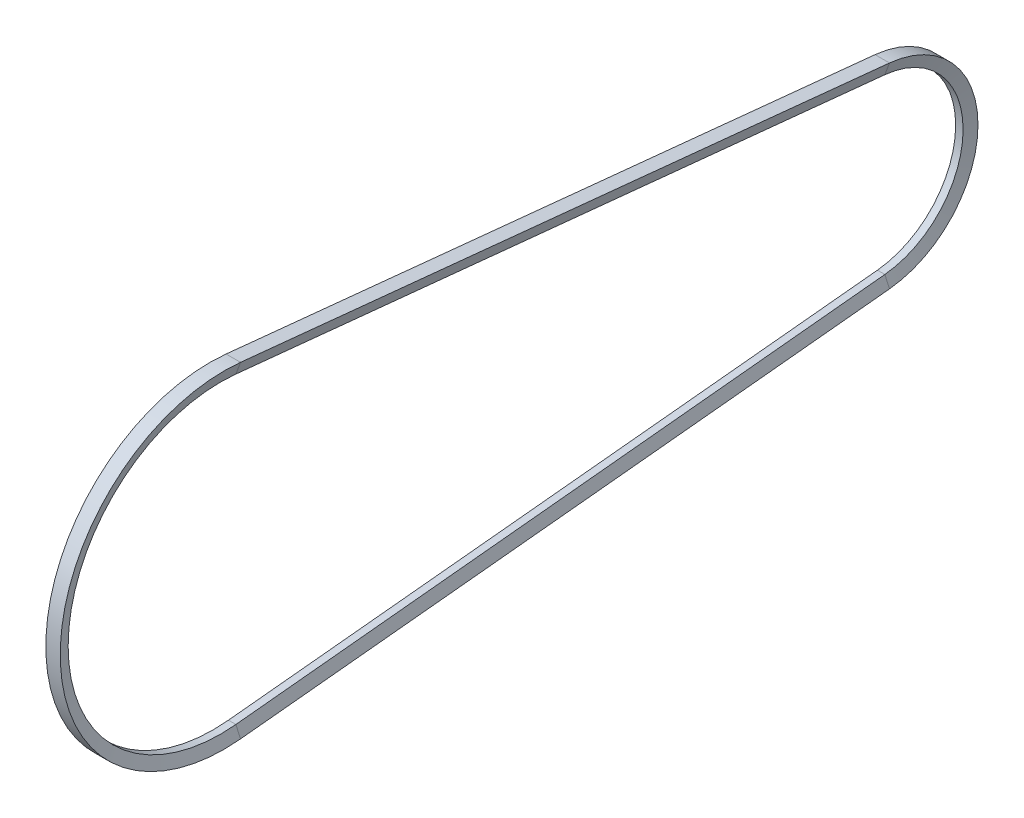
ISO-10303-21;
HEADER;
FILE_DESCRIPTION(('STEP AP214'),'2;1');
FILE_NAME('part.step','',(''),(''),'','','');
FILE_SCHEMA(('AUTOMOTIVE_DESIGN { 1 0 10303 214 1 1 1 1 }'));
ENDSEC;
DATA;
#1=APPLICATION_CONTEXT('core data for automotive mechanical design processes');
#2=APPLICATION_PROTOCOL_DEFINITION('international standard','automotive_design',2000,#1);
#3=PRODUCT_CONTEXT('',#1,'mechanical');
#4=PRODUCT('Part','Part','',(#3));
#5=PRODUCT_RELATED_PRODUCT_CATEGORY('part','',(#4));
#6=PRODUCT_DEFINITION_FORMATION('','',#4);
#7=PRODUCT_DEFINITION_CONTEXT('part definition',#1,'design');
#8=PRODUCT_DEFINITION('design','',#6,#7);
#9=PRODUCT_DEFINITION_SHAPE('','',#8);
#10=(LENGTH_UNIT() NAMED_UNIT(*) SI_UNIT(.MILLI.,.METRE.));
#11=(NAMED_UNIT(*) PLANE_ANGLE_UNIT() SI_UNIT($,.RADIAN.));
#12=(NAMED_UNIT(*) SI_UNIT($,.STERADIAN.) SOLID_ANGLE_UNIT());
#13=UNCERTAINTY_MEASURE_WITH_UNIT(LENGTH_MEASURE(1.E-05),#10,'distance_accuracy_value','');
#14=(GEOMETRIC_REPRESENTATION_CONTEXT(3) GLOBAL_UNCERTAINTY_ASSIGNED_CONTEXT((#13)) GLOBAL_UNIT_ASSIGNED_CONTEXT((#10,
#11,#12)) REPRESENTATION_CONTEXT('',''));
#15=CARTESIAN_POINT('',(0.,0.,0.));
#16=DIRECTION('',(0.,0.,1.));
#17=DIRECTION('',(1.,0.,0.));
#18=AXIS2_PLACEMENT_3D('',#15,#16,#17);
#19=CARTESIAN_POINT('',(2.84014307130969,65.967667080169,-506.629999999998));
#20=DIRECTION('',(0.,-0.99498743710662,0.1));
#21=DIRECTION('',(0.,-0.1,-0.99498743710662));
#22=AXIS2_PLACEMENT_3D('',#19,#20,#21);
#23=PLANE('',#22);
#24=DIRECTION('',(1.,0.,0.));
#25=VECTOR('',#24,1.);
#26=CARTESIAN_POINT('',(2.84014307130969,65.967667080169,-506.629999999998));
#27=LINE('',#26,#25);
#28=CARTESIAN_POINT('',(-2.84014307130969,65.967667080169,-506.629999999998));
#29=VERTEX_POINT('',#28);
#30=CARTESIAN_POINT('',(2.84014307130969,65.967667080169,-506.629999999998));
#31=VERTEX_POINT('',#30);
#32=EDGE_CURVE('E157',#29,#31,#27,.T.);
#33=ORIENTED_EDGE('',*,*,#32,.T.);
#34=DIRECTION('',(0.,0.1,0.99498743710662));
#35=VECTOR('',#34,1.);
#36=CARTESIAN_POINT('',(2.84014307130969,65.967667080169,-506.629999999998));
#37=LINE('',#36,#35);
#38=CARTESIAN_POINT('',(2.84014307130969,115.7170389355,-11.6299999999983));
#39=VERTEX_POINT('',#38);
#40=EDGE_CURVE('E38',#31,#39,#37,.T.);
#41=ORIENTED_EDGE('',*,*,#40,.T.);
#42=DIRECTION('',(1.,0.,0.));
#43=VECTOR('',#42,1.);
#44=CARTESIAN_POINT('',(2.84014307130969,115.7170389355,-11.6299999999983));
#45=LINE('',#44,#43);
#46=CARTESIAN_POINT('',(-2.84014307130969,115.7170389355,-11.6299999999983));
#47=VERTEX_POINT('',#46);
#48=EDGE_CURVE('E178',#47,#39,#45,.T.);
#49=ORIENTED_EDGE('',*,*,#48,.F.);
#50=DIRECTION('',(0.,0.1,0.99498743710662));
#51=VECTOR('',#50,1.);
#52=CARTESIAN_POINT('',(-2.84014307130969,65.967667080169,-506.629999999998));
#53=LINE('',#52,#51);
#54=EDGE_CURVE('E11',#29,#47,#53,.T.);
#55=ORIENTED_EDGE('',*,*,#54,.F.);
#56=EDGE_LOOP('',(#33,#41,#49,#55));
#57=FACE_BOUND('',#56,.T.);
#58=ADVANCED_FACE('F30',(#57),#23,.T.);
#59=CARTESIAN_POINT('',(5.5,74.6240577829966,-507.499999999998));
#60=DIRECTION('',(0.956304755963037,-0.290906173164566,0.0292371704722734));
#61=DIRECTION('',(0.29103058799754,0.956713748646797,0.));
#62=AXIS2_PLACEMENT_3D('',#59,#60,#61);
#63=PLANE('',#62);
#64=DIRECTION('',(0.292371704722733,0.951511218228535,-0.0956304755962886));
#65=VECTOR('',#64,1.);
#66=CARTESIAN_POINT('',(5.5,74.6240577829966,-507.499999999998));
#67=LINE('',#66,#65);
#68=CARTESIAN_POINT('',(5.5,74.6240577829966,-507.499999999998));
#69=VERTEX_POINT('',#68);
#70=EDGE_CURVE('E154',#31,#69,#67,.T.);
#71=ORIENTED_EDGE('',*,*,#70,.T.);
#72=DIRECTION('',(0.,0.1,0.99498743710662));
#73=VECTOR('',#72,1.);
#74=CARTESIAN_POINT('',(5.5,74.6240577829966,-507.499999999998));
#75=LINE('',#74,#73);
#76=CARTESIAN_POINT('',(5.5,124.373429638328,-12.4999999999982));
#77=VERTEX_POINT('',#76);
#78=EDGE_CURVE('E183',#69,#77,#75,.T.);
#79=ORIENTED_EDGE('',*,*,#78,.T.);
#80=DIRECTION('',(0.292371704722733,0.951511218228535,-0.0956304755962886));
#81=VECTOR('',#80,1.);
#82=CARTESIAN_POINT('',(5.5,124.373429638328,-12.4999999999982));
#83=LINE('',#82,#81);
#84=EDGE_CURVE('E176',#39,#77,#83,.T.);
#85=ORIENTED_EDGE('',*,*,#84,.F.);
#86=ORIENTED_EDGE('',*,*,#40,.F.);
#87=EDGE_LOOP('',(#71,#79,#85,#86));
#88=FACE_BOUND('',#87,.T.);
#89=ADVANCED_FACE('F207',(#88),#63,.T.);
#90=CARTESIAN_POINT('',(-5.5,74.6240577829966,-507.499999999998));
#91=DIRECTION('',(0.,0.99498743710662,-0.1));
#92=DIRECTION('',(0.,0.1,0.99498743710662));
#93=AXIS2_PLACEMENT_3D('',#90,#91,#92);
#94=PLANE('',#93);
#95=DIRECTION('',(-1.,0.,0.));
#96=VECTOR('',#95,1.);
#97=CARTESIAN_POINT('',(-5.5,74.6240577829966,-507.499999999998));
#98=LINE('',#97,#96);
#99=CARTESIAN_POINT('',(-5.5,74.6240577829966,-507.499999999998));
#100=VERTEX_POINT('',#99);
#101=EDGE_CURVE('E151',#69,#100,#98,.T.);
#102=ORIENTED_EDGE('',*,*,#101,.T.);
#103=DIRECTION('',(0.,0.1,0.99498743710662));
#104=VECTOR('',#103,1.);
#105=CARTESIAN_POINT('',(-5.5,74.6240577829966,-507.499999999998));
#106=LINE('',#105,#104);
#107=CARTESIAN_POINT('',(-5.5,124.373429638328,-12.4999999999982));
#108=VERTEX_POINT('',#107);
#109=EDGE_CURVE('E180',#100,#108,#106,.T.);
#110=ORIENTED_EDGE('',*,*,#109,.T.);
#111=DIRECTION('',(-1.,0.,0.));
#112=VECTOR('',#111,1.);
#113=CARTESIAN_POINT('',(-5.5,124.373429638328,-12.4999999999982));
#114=LINE('',#113,#112);
#115=EDGE_CURVE('E173',#77,#108,#114,.T.);
#116=ORIENTED_EDGE('',*,*,#115,.F.);
#117=ORIENTED_EDGE('',*,*,#78,.F.);
#118=EDGE_LOOP('',(#102,#110,#116,#117));
#119=FACE_BOUND('',#118,.T.);
#120=ADVANCED_FACE('F206',(#119),#94,.T.);
#121=CARTESIAN_POINT('',(-2.84014307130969,65.967667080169,-506.629999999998));
#122=DIRECTION('',(-0.956304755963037,-0.290906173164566,0.0292371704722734));
#123=DIRECTION('',(0.29103058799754,-0.956713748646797,0.));
#124=AXIS2_PLACEMENT_3D('',#121,#122,#123);
#125=PLANE('',#124);
#126=DIRECTION('',(0.292371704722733,-0.951511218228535,0.0956304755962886));
#127=VECTOR('',#126,1.);
#128=CARTESIAN_POINT('',(-2.84014307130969,65.967667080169,-506.629999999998));
#129=LINE('',#128,#127);
#130=EDGE_CURVE('E109',#100,#29,#129,.T.);
#131=ORIENTED_EDGE('',*,*,#130,.T.);
#132=ORIENTED_EDGE('',*,*,#54,.T.);
#133=DIRECTION('',(0.292371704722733,-0.951511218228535,0.0956304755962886));
#134=VECTOR('',#133,1.);
#135=CARTESIAN_POINT('',(-2.84014307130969,115.7170389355,-11.6299999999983));
#136=LINE('',#135,#134);
#137=EDGE_CURVE('E122',#108,#47,#136,.T.);
#138=ORIENTED_EDGE('',*,*,#137,.F.);
#139=ORIENTED_EDGE('',*,*,#109,.F.);
#140=EDGE_LOOP('',(#131,#132,#138,#139));
#141=FACE_BOUND('',#140,.T.);
#142=ADVANCED_FACE('F240',(#141),#125,.T.);
#143=CARTESIAN_POINT('',(0.,0.,-500.));
#144=DIRECTION('',(1.,0.,0.));
#145=DIRECTION('',(0.,0.,-1.));
#146=AXIS2_PLACEMENT_3D('',#143,#144,#145);
#147=CYLINDRICAL_SURFACE('',#146,66.2999999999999);
#148=DIRECTION('',(1.,0.,0.));
#149=VECTOR('',#148,1.);
#150=CARTESIAN_POINT('',(2.84014307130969,-65.9676670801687,-506.630000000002));
#151=LINE('',#150,#149);
#152=CARTESIAN_POINT('',(-2.84014307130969,-65.9676670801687,-506.630000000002));
#153=VERTEX_POINT('',#152);
#154=CARTESIAN_POINT('',(2.84014307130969,-65.9676670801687,-506.630000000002));
#155=VERTEX_POINT('',#154);
#156=EDGE_CURVE('E106',#153,#155,#151,.T.);
#157=ORIENTED_EDGE('',*,*,#156,.T.);
#158=CARTESIAN_POINT('',(2.84014307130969,0.,-500.));
#159=DIRECTION('',(1.,0.,0.));
#160=DIRECTION('',(0.,0.,-1.));
#161=AXIS2_PLACEMENT_3D('',#158,#159,#160);
#162=CIRCLE('',#161,66.2999999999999);
#163=EDGE_CURVE('E166',#155,#31,#162,.T.);
#164=ORIENTED_EDGE('',*,*,#163,.T.);
#165=ORIENTED_EDGE('',*,*,#32,.F.);
#166=CARTESIAN_POINT('',(-2.84014307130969,0.,-500.));
#167=DIRECTION('',(1.,0.,0.));
#168=DIRECTION('',(0.,0.,-1.));
#169=AXIS2_PLACEMENT_3D('',#166,#167,#168);
#170=CIRCLE('',#169,66.2999999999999);
#171=EDGE_CURVE('E169',#153,#29,#170,.T.);
#172=ORIENTED_EDGE('',*,*,#171,.F.);
#173=EDGE_LOOP('',(#157,#164,#165,#172));
#174=FACE_BOUND('',#173,.T.);
#175=ADVANCED_FACE('F237',(#174),#147,.F.);
#176=CARTESIAN_POINT('',(2.84014307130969,0.,-500.));
#177=DIRECTION('',(1.,0.,0.));
#178=DIRECTION('',(0.,0.,-1.));
#179=AXIS2_PLACEMENT_3D('',#176,#177,#178);
#180=CONICAL_SURFACE('',#179,66.2999999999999,1.27409035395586);
#181=DIRECTION('',(0.292371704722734,-0.951511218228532,-0.0956304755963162));
#182=VECTOR('',#181,1.);
#183=CARTESIAN_POINT('',(5.5,-74.6240577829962,-507.500000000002));
#184=LINE('',#183,#182);
#185=CARTESIAN_POINT('',(5.5,-74.6240577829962,-507.500000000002));
#186=VERTEX_POINT('',#185);
#187=EDGE_CURVE('E140',#155,#186,#184,.T.);
#188=ORIENTED_EDGE('',*,*,#187,.T.);
#189=CARTESIAN_POINT('',(5.5,0.,-500.));
#190=DIRECTION('',(1.,0.,0.));
#191=DIRECTION('',(0.,0.,-1.));
#192=AXIS2_PLACEMENT_3D('',#189,#190,#191);
#193=CIRCLE('',#192,74.9999999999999);
#194=EDGE_CURVE('E163',#186,#69,#193,.T.);
#195=ORIENTED_EDGE('',*,*,#194,.T.);
#196=ORIENTED_EDGE('',*,*,#70,.F.);
#197=ORIENTED_EDGE('',*,*,#163,.F.);
#198=EDGE_LOOP('',(#188,#195,#196,#197));
#199=FACE_BOUND('',#198,.T.);
#200=ADVANCED_FACE('F214',(#199),#180,.F.);
#201=CARTESIAN_POINT('',(0.,0.,-500.));
#202=DIRECTION('',(1.,0.,0.));
#203=DIRECTION('',(0.,0.,-1.));
#204=AXIS2_PLACEMENT_3D('',#201,#202,#203);
#205=CYLINDRICAL_SURFACE('',#204,74.9999999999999);
#206=DIRECTION('',(-1.,0.,0.));
#207=VECTOR('',#206,1.);
#208=CARTESIAN_POINT('',(-5.5,-74.6240577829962,-507.500000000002));
#209=LINE('',#208,#207);
#210=CARTESIAN_POINT('',(-5.5,-74.6240577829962,-507.500000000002));
#211=VERTEX_POINT('',#210);
#212=EDGE_CURVE('E136',#186,#211,#209,.T.);
#213=ORIENTED_EDGE('',*,*,#212,.T.);
#214=CARTESIAN_POINT('',(-5.5,0.,-500.));
#215=DIRECTION('',(1.,0.,0.));
#216=DIRECTION('',(0.,0.,-1.));
#217=AXIS2_PLACEMENT_3D('',#214,#215,#216);
#218=CIRCLE('',#217,74.9999999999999);
#219=EDGE_CURVE('E160',#211,#100,#218,.T.);
#220=ORIENTED_EDGE('',*,*,#219,.T.);
#221=ORIENTED_EDGE('',*,*,#101,.F.);
#222=ORIENTED_EDGE('',*,*,#194,.F.);
#223=EDGE_LOOP('',(#213,#220,#221,#222));
#224=FACE_BOUND('',#223,.T.);
#225=ADVANCED_FACE('F212',(#224),#205,.T.);
#226=CARTESIAN_POINT('',(-5.5,0.,-500.));
#227=DIRECTION('',(-1.,0.,0.));
#228=DIRECTION('',(0.,0.,1.));
#229=AXIS2_PLACEMENT_3D('',#226,#227,#228);
#230=CONICAL_SURFACE('',#229,74.9999999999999,1.27409035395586);
#231=DIRECTION('',(0.292371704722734,0.951511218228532,0.0956304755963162));
#232=VECTOR('',#231,1.);
#233=CARTESIAN_POINT('',(-2.84014307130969,-65.9676670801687,-506.630000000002));
#234=LINE('',#233,#232);
#235=EDGE_CURVE('E133',#211,#153,#234,.T.);
#236=ORIENTED_EDGE('',*,*,#235,.T.);
#237=ORIENTED_EDGE('',*,*,#171,.T.);
#238=ORIENTED_EDGE('',*,*,#130,.F.);
#239=ORIENTED_EDGE('',*,*,#219,.F.);
#240=EDGE_LOOP('',(#236,#237,#238,#239));
#241=FACE_BOUND('',#240,.T.);
#242=ADVANCED_FACE('F228',(#241),#230,.F.);
#243=CARTESIAN_POINT('',(2.84014307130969,-115.7170389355,-11.6300000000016));
#244=DIRECTION('',(0.,0.99498743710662,0.1));
#245=DIRECTION('',(0.,-0.1,0.99498743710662));
#246=AXIS2_PLACEMENT_3D('',#243,#244,#245);
#247=PLANE('',#246);
#248=DIRECTION('',(1.,0.,0.));
#249=VECTOR('',#248,1.);
#250=CARTESIAN_POINT('',(2.84014307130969,-115.7170389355,-11.6300000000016));
#251=LINE('',#250,#249);
#252=CARTESIAN_POINT('',(-2.84014307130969,-115.7170389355,-11.6300000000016));
#253=VERTEX_POINT('',#252);
#254=CARTESIAN_POINT('',(2.84014307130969,-115.7170389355,-11.6300000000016));
#255=VERTEX_POINT('',#254);
#256=EDGE_CURVE('E104',#253,#255,#251,.T.);
#257=ORIENTED_EDGE('',*,*,#256,.T.);
#258=DIRECTION('',(0.,0.1,-0.99498743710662));
#259=VECTOR('',#258,1.);
#260=CARTESIAN_POINT('',(2.84014307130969,-115.7170389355,-11.6300000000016));
#261=LINE('',#260,#259);
#262=EDGE_CURVE('E110',#255,#155,#261,.T.);
#263=ORIENTED_EDGE('',*,*,#262,.T.);
#264=ORIENTED_EDGE('',*,*,#156,.F.);
#265=DIRECTION('',(0.,0.1,-0.99498743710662));
#266=VECTOR('',#265,1.);
#267=CARTESIAN_POINT('',(-2.84014307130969,-115.7170389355,-11.6300000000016));
#268=LINE('',#267,#266);
#269=EDGE_CURVE('E100',#253,#153,#268,.T.);
#270=ORIENTED_EDGE('',*,*,#269,.F.);
#271=EDGE_LOOP('',(#257,#263,#264,#270));
#272=FACE_BOUND('',#271,.T.);
#273=ADVANCED_FACE('F102',(#272),#247,.T.);
#274=CARTESIAN_POINT('',(5.5,-124.373429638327,-12.5000000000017));
#275=DIRECTION('',(0.956304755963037,0.290906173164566,0.0292371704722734));
#276=DIRECTION('',(-0.29103058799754,0.956713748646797,0.));
#277=AXIS2_PLACEMENT_3D('',#274,#275,#276);
#278=PLANE('',#277);
#279=DIRECTION('',(0.292371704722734,-0.951511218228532,-0.0956304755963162));
#280=VECTOR('',#279,1.);
#281=CARTESIAN_POINT('',(5.5,-124.373429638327,-12.5000000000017));
#282=LINE('',#281,#280);
#283=CARTESIAN_POINT('',(5.5,-124.373429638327,-12.5000000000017));
#284=VERTEX_POINT('',#283);
#285=EDGE_CURVE('E127',#255,#284,#282,.T.);
#286=ORIENTED_EDGE('',*,*,#285,.T.);
#287=DIRECTION('',(0.,0.1,-0.99498743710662));
#288=VECTOR('',#287,1.);
#289=CARTESIAN_POINT('',(5.5,-124.373429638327,-12.5000000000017));
#290=LINE('',#289,#288);
#291=EDGE_CURVE('E145',#284,#186,#290,.T.);
#292=ORIENTED_EDGE('',*,*,#291,.T.);
#293=ORIENTED_EDGE('',*,*,#187,.F.);
#294=ORIENTED_EDGE('',*,*,#262,.F.);
#295=EDGE_LOOP('',(#286,#292,#293,#294));
#296=FACE_BOUND('',#295,.T.);
#297=ADVANCED_FACE('F220',(#296),#278,.T.);
#298=CARTESIAN_POINT('',(-5.5,-124.373429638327,-12.5000000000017));
#299=DIRECTION('',(0.,-0.99498743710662,-0.1));
#300=DIRECTION('',(0.,0.1,-0.99498743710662));
#301=AXIS2_PLACEMENT_3D('',#298,#299,#300);
#302=PLANE('',#301);
#303=DIRECTION('',(-1.,0.,0.));
#304=VECTOR('',#303,1.);
#305=CARTESIAN_POINT('',(-5.5,-124.373429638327,-12.5000000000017));
#306=LINE('',#305,#304);
#307=CARTESIAN_POINT('',(-5.5,-124.373429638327,-12.5000000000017));
#308=VERTEX_POINT('',#307);
#309=EDGE_CURVE('E124',#284,#308,#306,.T.);
#310=ORIENTED_EDGE('',*,*,#309,.T.);
#311=DIRECTION('',(0.,0.1,-0.99498743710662));
#312=VECTOR('',#311,1.);
#313=CARTESIAN_POINT('',(-5.5,-124.373429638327,-12.5000000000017));
#314=LINE('',#313,#312);
#315=EDGE_CURVE('E116',#308,#211,#314,.T.);
#316=ORIENTED_EDGE('',*,*,#315,.T.);
#317=ORIENTED_EDGE('',*,*,#212,.F.);
#318=ORIENTED_EDGE('',*,*,#291,.F.);
#319=EDGE_LOOP('',(#310,#316,#317,#318));
#320=FACE_BOUND('',#319,.T.);
#321=ADVANCED_FACE('F219',(#320),#302,.T.);
#322=CARTESIAN_POINT('',(-2.84014307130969,-115.7170389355,-11.6300000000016));
#323=DIRECTION('',(-0.956304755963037,0.290906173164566,0.0292371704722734));
#324=DIRECTION('',(-0.29103058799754,-0.956713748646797,0.));
#325=AXIS2_PLACEMENT_3D('',#322,#323,#324);
#326=PLANE('',#325);
#327=DIRECTION('',(0.292371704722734,0.951511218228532,0.0956304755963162));
#328=VECTOR('',#327,1.);
#329=CARTESIAN_POINT('',(-2.84014307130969,-115.7170389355,-11.6300000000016));
#330=LINE('',#329,#328);
#331=EDGE_CURVE('E113',#308,#253,#330,.T.);
#332=ORIENTED_EDGE('',*,*,#331,.T.);
#333=ORIENTED_EDGE('',*,*,#269,.T.);
#334=ORIENTED_EDGE('',*,*,#235,.F.);
#335=ORIENTED_EDGE('',*,*,#315,.F.);
#336=EDGE_LOOP('',(#332,#333,#334,#335));
#337=FACE_BOUND('',#336,.T.);
#338=ADVANCED_FACE('F114',(#337),#326,.T.);
#339=CARTESIAN_POINT('',(-5.5,0.,0.));
#340=DIRECTION('',(-1.,0.,0.));
#341=DIRECTION('',(0.,0.,1.));
#342=AXIS2_PLACEMENT_3D('',#339,#340,#341);
#343=CONICAL_SURFACE('',#342,125.,1.27409035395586);
#344=CARTESIAN_POINT('',(-5.5,0.,0.));
#345=DIRECTION('',(-1.,0.,0.));
#346=DIRECTION('',(0.,0.,1.));
#347=AXIS2_PLACEMENT_3D('',#344,#345,#346);
#348=CIRCLE('',#347,125.);
#349=EDGE_CURVE('E137',#308,#108,#348,.T.);
#350=ORIENTED_EDGE('',*,*,#349,.T.);
#351=ORIENTED_EDGE('',*,*,#137,.T.);
#352=CARTESIAN_POINT('',(-2.84014307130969,0.,0.));
#353=DIRECTION('',(-1.,0.,0.));
#354=DIRECTION('',(0.,0.,1.));
#355=AXIS2_PLACEMENT_3D('',#352,#353,#354);
#356=CIRCLE('',#355,116.3);
#357=EDGE_CURVE('E46',#253,#47,#356,.T.);
#358=ORIENTED_EDGE('',*,*,#357,.F.);
#359=ORIENTED_EDGE('',*,*,#331,.F.);
#360=EDGE_LOOP('',(#350,#351,#358,#359));
#361=FACE_BOUND('',#360,.T.);
#362=ADVANCED_FACE('F120',(#361),#343,.F.);
#363=CARTESIAN_POINT('',(0.,0.,0.));
#364=DIRECTION('',(-1.,0.,0.));
#365=DIRECTION('',(0.,0.,1.));
#366=AXIS2_PLACEMENT_3D('',#363,#364,#365);
#367=CYLINDRICAL_SURFACE('',#366,125.);
#368=CARTESIAN_POINT('',(5.5,0.,0.));
#369=DIRECTION('',(-1.,0.,0.));
#370=DIRECTION('',(0.,0.,1.));
#371=AXIS2_PLACEMENT_3D('',#368,#369,#370);
#372=CIRCLE('',#371,125.);
#373=EDGE_CURVE('E191',#284,#77,#372,.T.);
#374=ORIENTED_EDGE('',*,*,#373,.T.);
#375=ORIENTED_EDGE('',*,*,#115,.T.);
#376=ORIENTED_EDGE('',*,*,#349,.F.);
#377=ORIENTED_EDGE('',*,*,#309,.F.);
#378=EDGE_LOOP('',(#374,#375,#376,#377));
#379=FACE_BOUND('',#378,.T.);
#380=ADVANCED_FACE('F199',(#379),#367,.T.);
#381=CARTESIAN_POINT('',(2.84014307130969,0.,0.));
#382=DIRECTION('',(1.,0.,0.));
#383=DIRECTION('',(0.,0.,-1.));
#384=AXIS2_PLACEMENT_3D('',#381,#382,#383);
#385=CONICAL_SURFACE('',#384,116.3,1.27409035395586);
#386=CARTESIAN_POINT('',(2.84014307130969,0.,0.));
#387=DIRECTION('',(-1.,0.,0.));
#388=DIRECTION('',(0.,0.,1.));
#389=AXIS2_PLACEMENT_3D('',#386,#387,#388);
#390=CIRCLE('',#389,116.3);
#391=EDGE_CURVE('E54',#255,#39,#390,.T.);
#392=ORIENTED_EDGE('',*,*,#391,.T.);
#393=ORIENTED_EDGE('',*,*,#84,.T.);
#394=ORIENTED_EDGE('',*,*,#373,.F.);
#395=ORIENTED_EDGE('',*,*,#285,.F.);
#396=EDGE_LOOP('',(#392,#393,#394,#395));
#397=FACE_BOUND('',#396,.T.);
#398=ADVANCED_FACE('F203',(#397),#385,.F.);
#399=CARTESIAN_POINT('',(0.,0.,0.));
#400=DIRECTION('',(-1.,0.,0.));
#401=DIRECTION('',(0.,0.,1.));
#402=AXIS2_PLACEMENT_3D('',#399,#400,#401);
#403=CYLINDRICAL_SURFACE('',#402,116.3);
#404=ORIENTED_EDGE('',*,*,#256,.F.);
#405=ORIENTED_EDGE('',*,*,#357,.T.);
#406=ORIENTED_EDGE('',*,*,#48,.T.);
#407=ORIENTED_EDGE('',*,*,#391,.F.);
#408=EDGE_LOOP('',(#404,#405,#406,#407));
#409=FACE_BOUND('',#408,.T.);
#410=ADVANCED_FACE('F126',(#409),#403,.F.);
#411=CLOSED_SHELL('',(#58,#89,#120,#142,#175,#200,#225,#242,#273,#297,#321,#338,#362,#380,#398,#410));
#412=MANIFOLD_SOLID_BREP('B2',#411);
#413=ADVANCED_BREP_SHAPE_REPRESENTATION('',(#18,#412),#14);
#414=SHAPE_DEFINITION_REPRESENTATION(#9,#413);
ENDSEC;
END-ISO-10303-21;
